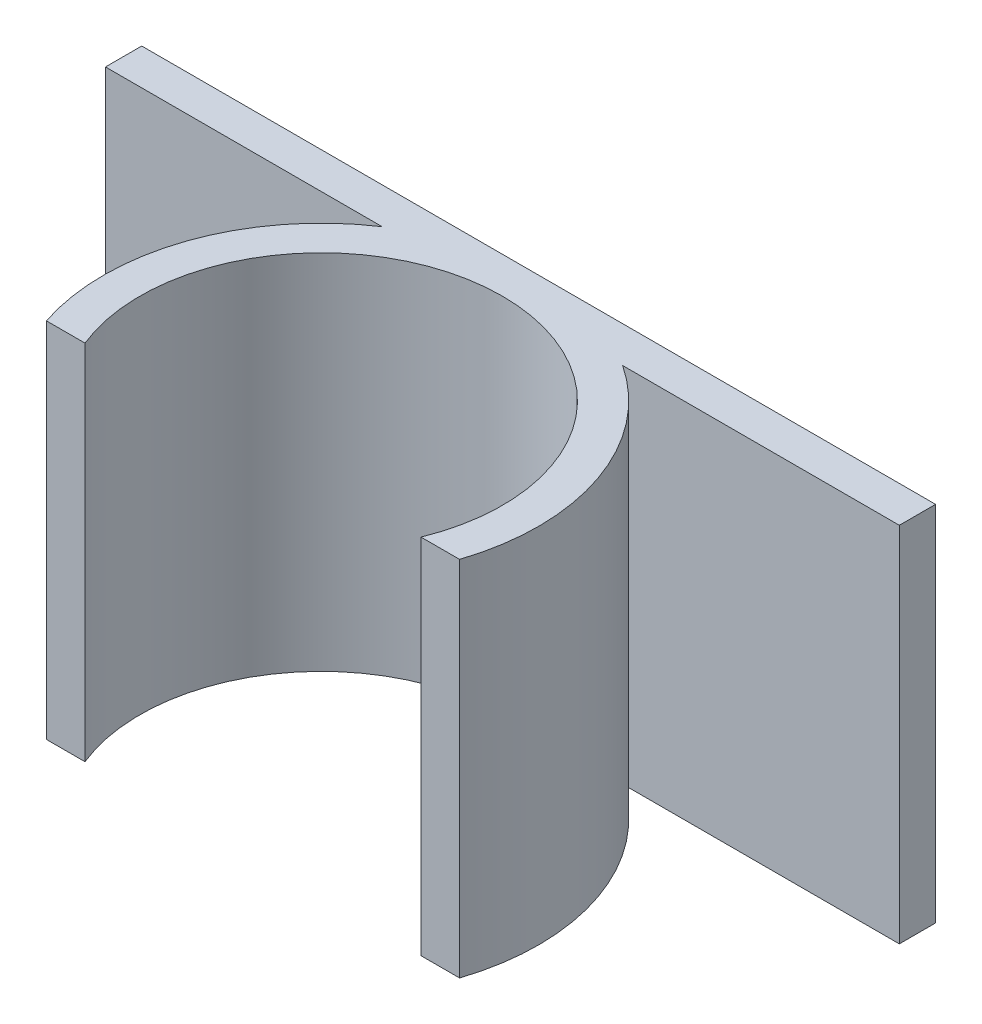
ISO-10303-21;
HEADER;
FILE_DESCRIPTION(('STEP AP214'),'2;1');
FILE_NAME('part.step','',(''),(''),'','','');
FILE_SCHEMA(('AUTOMOTIVE_DESIGN { 1 0 10303 214 1 1 1 1 }'));
ENDSEC;
DATA;
#1=APPLICATION_CONTEXT('core data for automotive mechanical design processes');
#2=APPLICATION_PROTOCOL_DEFINITION('international standard','automotive_design',2000,#1);
#3=PRODUCT_CONTEXT('',#1,'mechanical');
#4=PRODUCT('Part','Part','',(#3));
#5=PRODUCT_RELATED_PRODUCT_CATEGORY('part','',(#4));
#6=PRODUCT_DEFINITION_FORMATION('','',#4);
#7=PRODUCT_DEFINITION_CONTEXT('part definition',#1,'design');
#8=PRODUCT_DEFINITION('design','',#6,#7);
#9=PRODUCT_DEFINITION_SHAPE('','',#8);
#10=(LENGTH_UNIT() NAMED_UNIT(*) SI_UNIT(.MILLI.,.METRE.));
#11=(NAMED_UNIT(*) PLANE_ANGLE_UNIT() SI_UNIT($,.RADIAN.));
#12=(NAMED_UNIT(*) SI_UNIT($,.STERADIAN.) SOLID_ANGLE_UNIT());
#13=UNCERTAINTY_MEASURE_WITH_UNIT(LENGTH_MEASURE(1.E-05),#10,'distance_accuracy_value','');
#14=(GEOMETRIC_REPRESENTATION_CONTEXT(3) GLOBAL_UNCERTAINTY_ASSIGNED_CONTEXT((#13)) GLOBAL_UNIT_ASSIGNED_CONTEXT((#10,
#11,#12)) REPRESENTATION_CONTEXT('',''));
#15=CARTESIAN_POINT('',(0.,0.,0.));
#16=DIRECTION('',(0.,0.,1.));
#17=DIRECTION('',(1.,0.,0.));
#18=AXIS2_PLACEMENT_3D('',#15,#16,#17);
#19=CARTESIAN_POINT('',(0.,10.,0.));
#20=DIRECTION('',(0.,-1.,0.));
#21=DIRECTION('',(0.,0.,-1.));
#22=AXIS2_PLACEMENT_3D('',#19,#20,#21);
#23=CYLINDRICAL_SURFACE('',#22,6.);
#24=CARTESIAN_POINT('',(0.,0.,0.));
#25=DIRECTION('',(0.,1.,0.));
#26=DIRECTION('',(0.,0.,1.));
#27=AXIS2_PLACEMENT_3D('',#24,#25,#26);
#28=CIRCLE('',#27,6.);
#29=CARTESIAN_POINT('',(-3.31662479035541,0.,-5.));
#30=VERTEX_POINT('',#29);
#31=CARTESIAN_POINT('',(-5.69809388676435,0.,1.87928871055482));
#32=VERTEX_POINT('',#31);
#33=EDGE_CURVE('E156',#30,#32,#28,.T.);
#34=ORIENTED_EDGE('',*,*,#33,.T.);
#35=DIRECTION('',(0.,-1.,0.));
#36=VECTOR('',#35,1.);
#37=CARTESIAN_POINT('',(-5.69809388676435,10.,1.87928871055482));
#38=LINE('',#37,#36);
#39=CARTESIAN_POINT('',(-5.69809388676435,10.,1.87928871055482));
#40=VERTEX_POINT('',#39);
#41=EDGE_CURVE('E141',#32,#40,#38,.F.);
#42=ORIENTED_EDGE('',*,*,#41,.T.);
#43=CARTESIAN_POINT('',(0.,10.,0.));
#44=DIRECTION('',(0.,1.,0.));
#45=DIRECTION('',(0.,0.,1.));
#46=AXIS2_PLACEMENT_3D('',#43,#44,#45);
#47=CIRCLE('',#46,6.);
#48=CARTESIAN_POINT('',(-3.31662479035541,10.,-5.));
#49=VERTEX_POINT('',#48);
#50=EDGE_CURVE('E169',#49,#40,#47,.T.);
#51=ORIENTED_EDGE('',*,*,#50,.F.);
#52=DIRECTION('',(0.,-1.,0.));
#53=VECTOR('',#52,1.);
#54=CARTESIAN_POINT('',(-3.31662479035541,10.,-5.));
#55=LINE('',#54,#53);
#56=EDGE_CURVE('E164',#49,#30,#55,.T.);
#57=ORIENTED_EDGE('',*,*,#56,.T.);
#58=EDGE_LOOP('',(#34,#42,#51,#57));
#59=FACE_BOUND('',#58,.T.);
#60=ADVANCED_FACE('F67',(#59),#23,.T.);
#61=CARTESIAN_POINT('',(5.69809388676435,10.,1.87928871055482));
#62=VERTEX_POINT('',#61);
#63=CARTESIAN_POINT('',(3.31662479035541,10.,-5.));
#64=VERTEX_POINT('',#63);
#65=EDGE_CURVE('E166',#62,#64,#47,.T.);
#66=ORIENTED_EDGE('',*,*,#65,.F.);
#67=DIRECTION('',(0.,-1.,0.));
#68=VECTOR('',#67,1.);
#69=CARTESIAN_POINT('',(5.69809388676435,10.,1.87928871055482));
#70=LINE('',#69,#68);
#71=CARTESIAN_POINT('',(5.69809388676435,0.,1.87928871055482));
#72=VERTEX_POINT('',#71);
#73=EDGE_CURVE('E149',#62,#72,#70,.T.);
#74=ORIENTED_EDGE('',*,*,#73,.T.);
#75=CARTESIAN_POINT('',(3.31662479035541,0.,-5.));
#76=VERTEX_POINT('',#75);
#77=EDGE_CURVE('E167',#72,#76,#28,.T.);
#78=ORIENTED_EDGE('',*,*,#77,.T.);
#79=DIRECTION('',(0.,-1.,0.));
#80=VECTOR('',#79,1.);
#81=CARTESIAN_POINT('',(3.31662479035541,10.,-5.));
#82=LINE('',#81,#80);
#83=EDGE_CURVE('E208',#64,#76,#82,.T.);
#84=ORIENTED_EDGE('',*,*,#83,.F.);
#85=EDGE_LOOP('',(#66,#74,#78,#84));
#86=FACE_BOUND('',#85,.T.);
#87=ADVANCED_FACE('F69',(#86),#23,.T.);
#88=CARTESIAN_POINT('',(0.,10.,0.));
#89=DIRECTION('',(0.,1.,0.));
#90=DIRECTION('',(0.,0.,1.));
#91=AXIS2_PLACEMENT_3D('',#88,#89,#90);
#92=PLANE('',#91);
#93=DIRECTION('',(1.,0.,0.));
#94=VECTOR('',#93,1.);
#95=CARTESIAN_POINT('',(-7.16333601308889,10.,1.87928871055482));
#96=LINE('',#95,#94);
#97=CARTESIAN_POINT('',(4.63338687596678,10.,1.87928871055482));
#98=VERTEX_POINT('',#97);
#99=EDGE_CURVE('E89',#98,#62,#96,.T.);
#100=ORIENTED_EDGE('',*,*,#99,.T.);
#101=ORIENTED_EDGE('',*,*,#65,.T.);
#102=DIRECTION('',(1.,0.,0.));
#103=VECTOR('',#102,1.);
#104=CARTESIAN_POINT('',(0.,10.,-5.));
#105=LINE('',#104,#103);
#106=CARTESIAN_POINT('',(10.9483288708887,10.,-5.));
#107=VERTEX_POINT('',#106);
#108=EDGE_CURVE('E225',#64,#107,#105,.T.);
#109=ORIENTED_EDGE('',*,*,#108,.T.);
#110=DIRECTION('',(0.,0.,1.));
#111=VECTOR('',#110,1.);
#112=CARTESIAN_POINT('',(10.9483288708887,10.,0.));
#113=LINE('',#112,#111);
#114=CARTESIAN_POINT('',(10.9483288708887,10.,-6.));
#115=VERTEX_POINT('',#114);
#116=EDGE_CURVE('E212',#115,#107,#113,.T.);
#117=ORIENTED_EDGE('',*,*,#116,.F.);
#118=DIRECTION('',(1.,0.,0.));
#119=VECTOR('',#118,1.);
#120=CARTESIAN_POINT('',(0.,10.,-6.));
#121=LINE('',#120,#119);
#122=CARTESIAN_POINT('',(-10.9483288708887,10.,-6.));
#123=VERTEX_POINT('',#122);
#124=EDGE_CURVE('E198',#123,#115,#121,.T.);
#125=ORIENTED_EDGE('',*,*,#124,.F.);
#126=DIRECTION('',(0.,0.,1.));
#127=VECTOR('',#126,1.);
#128=CARTESIAN_POINT('',(-10.9483288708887,10.,0.));
#129=LINE('',#128,#127);
#130=CARTESIAN_POINT('',(-10.9483288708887,10.,-5.));
#131=VERTEX_POINT('',#130);
#132=EDGE_CURVE('E182',#123,#131,#129,.T.);
#133=ORIENTED_EDGE('',*,*,#132,.T.);
#134=DIRECTION('',(1.,0.,0.));
#135=VECTOR('',#134,1.);
#136=CARTESIAN_POINT('',(0.,10.,-5.));
#137=LINE('',#136,#135);
#138=EDGE_CURVE('E179',#131,#49,#137,.T.);
#139=ORIENTED_EDGE('',*,*,#138,.T.);
#140=ORIENTED_EDGE('',*,*,#50,.T.);
#141=CARTESIAN_POINT('',(-4.63338687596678,10.,1.87928871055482));
#142=VERTEX_POINT('',#141);
#143=EDGE_CURVE('E144',#40,#142,#96,.T.);
#144=ORIENTED_EDGE('',*,*,#143,.T.);
#145=CARTESIAN_POINT('',(0.,10.,0.));
#146=DIRECTION('',(0.,1.,0.));
#147=DIRECTION('',(0.,0.,1.));
#148=AXIS2_PLACEMENT_3D('',#145,#146,#147);
#149=CIRCLE('',#148,5.);
#150=EDGE_CURVE('E171',#98,#142,#149,.T.);
#151=ORIENTED_EDGE('',*,*,#150,.F.);
#152=EDGE_LOOP('',(#100,#101,#109,#117,#125,#133,#139,#140,#144,#151));
#153=FACE_BOUND('',#152,.T.);
#154=ADVANCED_FACE('F175',(#153),#92,.T.);
#155=CARTESIAN_POINT('',(0.,0.,0.));
#156=DIRECTION('',(0.,1.,0.));
#157=DIRECTION('',(0.,0.,1.));
#158=AXIS2_PLACEMENT_3D('',#155,#156,#157);
#159=PLANE('',#158);
#160=ORIENTED_EDGE('',*,*,#77,.F.);
#161=DIRECTION('',(1.,0.,0.));
#162=VECTOR('',#161,1.);
#163=CARTESIAN_POINT('',(-7.16333601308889,0.,1.87928871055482));
#164=LINE('',#163,#162);
#165=CARTESIAN_POINT('',(4.63338687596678,0.,1.87928871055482));
#166=VERTEX_POINT('',#165);
#167=EDGE_CURVE('E161',#166,#72,#164,.T.);
#168=ORIENTED_EDGE('',*,*,#167,.F.);
#169=CARTESIAN_POINT('',(0.,0.,0.));
#170=DIRECTION('',(0.,1.,0.));
#171=DIRECTION('',(0.,0.,1.));
#172=AXIS2_PLACEMENT_3D('',#169,#170,#171);
#173=CIRCLE('',#172,5.);
#174=CARTESIAN_POINT('',(-4.63338687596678,0.,1.87928871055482));
#175=VERTEX_POINT('',#174);
#176=EDGE_CURVE('E160',#166,#175,#173,.T.);
#177=ORIENTED_EDGE('',*,*,#176,.T.);
#178=EDGE_CURVE('E82',#32,#175,#164,.T.);
#179=ORIENTED_EDGE('',*,*,#178,.F.);
#180=ORIENTED_EDGE('',*,*,#33,.F.);
#181=DIRECTION('',(1.,0.,0.));
#182=VECTOR('',#181,1.);
#183=CARTESIAN_POINT('',(0.,0.,-5.));
#184=LINE('',#183,#182);
#185=CARTESIAN_POINT('',(-10.9483288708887,0.,-5.));
#186=VERTEX_POINT('',#185);
#187=EDGE_CURVE('E189',#186,#30,#184,.T.);
#188=ORIENTED_EDGE('',*,*,#187,.F.);
#189=DIRECTION('',(0.,0.,1.));
#190=VECTOR('',#189,1.);
#191=CARTESIAN_POINT('',(-10.9483288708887,0.,0.));
#192=LINE('',#191,#190);
#193=CARTESIAN_POINT('',(-10.9483288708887,0.,-6.));
#194=VERTEX_POINT('',#193);
#195=EDGE_CURVE('E229',#194,#186,#192,.T.);
#196=ORIENTED_EDGE('',*,*,#195,.F.);
#197=DIRECTION('',(1.,0.,0.));
#198=VECTOR('',#197,1.);
#199=CARTESIAN_POINT('',(0.,0.,-6.));
#200=LINE('',#199,#198);
#201=CARTESIAN_POINT('',(10.9483288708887,0.,-6.));
#202=VERTEX_POINT('',#201);
#203=EDGE_CURVE('E186',#194,#202,#200,.T.);
#204=ORIENTED_EDGE('',*,*,#203,.T.);
#205=DIRECTION('',(0.,0.,1.));
#206=VECTOR('',#205,1.);
#207=CARTESIAN_POINT('',(10.9483288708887,0.,0.));
#208=LINE('',#207,#206);
#209=CARTESIAN_POINT('',(10.9483288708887,0.,-5.));
#210=VERTEX_POINT('',#209);
#211=EDGE_CURVE('E222',#202,#210,#208,.T.);
#212=ORIENTED_EDGE('',*,*,#211,.T.);
#213=DIRECTION('',(1.,0.,0.));
#214=VECTOR('',#213,1.);
#215=CARTESIAN_POINT('',(0.,0.,-5.));
#216=LINE('',#215,#214);
#217=EDGE_CURVE('E213',#76,#210,#216,.T.);
#218=ORIENTED_EDGE('',*,*,#217,.F.);
#219=EDGE_LOOP('',(#160,#168,#177,#179,#180,#188,#196,#204,#212,#218));
#220=FACE_BOUND('',#219,.T.);
#221=ADVANCED_FACE('F154',(#220),#159,.F.);
#222=CARTESIAN_POINT('',(0.,10.,0.));
#223=DIRECTION('',(0.,-1.,0.));
#224=DIRECTION('',(0.,0.,-1.));
#225=AXIS2_PLACEMENT_3D('',#222,#223,#224);
#226=CYLINDRICAL_SURFACE('',#225,5.);
#227=DIRECTION('',(0.,-1.,0.));
#228=VECTOR('',#227,1.);
#229=CARTESIAN_POINT('',(4.63338687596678,10.,1.87928871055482));
#230=LINE('',#229,#228);
#231=EDGE_CURVE('E12',#98,#166,#230,.T.);
#232=ORIENTED_EDGE('',*,*,#231,.F.);
#233=ORIENTED_EDGE('',*,*,#150,.T.);
#234=DIRECTION('',(0.,-1.,0.));
#235=VECTOR('',#234,1.);
#236=CARTESIAN_POINT('',(-4.63338687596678,10.,1.87928871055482));
#237=LINE('',#236,#235);
#238=EDGE_CURVE('E75',#175,#142,#237,.F.);
#239=ORIENTED_EDGE('',*,*,#238,.F.);
#240=ORIENTED_EDGE('',*,*,#176,.F.);
#241=EDGE_LOOP('',(#232,#233,#239,#240));
#242=FACE_BOUND('',#241,.T.);
#243=ADVANCED_FACE('F200',(#242),#226,.F.);
#244=CARTESIAN_POINT('',(0.,10.,-5.));
#245=DIRECTION('',(0.,0.,-1.));
#246=DIRECTION('',(-1.,0.,0.));
#247=AXIS2_PLACEMENT_3D('',#244,#245,#246);
#248=PLANE('',#247);
#249=ORIENTED_EDGE('',*,*,#187,.T.);
#250=ORIENTED_EDGE('',*,*,#56,.F.);
#251=ORIENTED_EDGE('',*,*,#138,.F.);
#252=DIRECTION('',(0.,-1.,0.));
#253=VECTOR('',#252,1.);
#254=CARTESIAN_POINT('',(-10.9483288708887,10.,-5.));
#255=LINE('',#254,#253);
#256=EDGE_CURVE('E192',#131,#186,#255,.T.);
#257=ORIENTED_EDGE('',*,*,#256,.T.);
#258=EDGE_LOOP('',(#249,#250,#251,#257));
#259=FACE_BOUND('',#258,.T.);
#260=ADVANCED_FACE('F188',(#259),#248,.F.);
#261=CARTESIAN_POINT('',(0.,10.,-6.));
#262=DIRECTION('',(0.,0.,-1.));
#263=DIRECTION('',(-1.,0.,0.));
#264=AXIS2_PLACEMENT_3D('',#261,#262,#263);
#265=PLANE('',#264);
#266=ORIENTED_EDGE('',*,*,#203,.F.);
#267=DIRECTION('',(0.,-1.,0.));
#268=VECTOR('',#267,1.);
#269=CARTESIAN_POINT('',(-10.9483288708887,10.,-6.));
#270=LINE('',#269,#268);
#271=EDGE_CURVE('E190',#123,#194,#270,.T.);
#272=ORIENTED_EDGE('',*,*,#271,.F.);
#273=ORIENTED_EDGE('',*,*,#124,.T.);
#274=DIRECTION('',(0.,-1.,0.));
#275=VECTOR('',#274,1.);
#276=CARTESIAN_POINT('',(10.9483288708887,10.,-6.));
#277=LINE('',#276,#275);
#278=EDGE_CURVE('E148',#115,#202,#277,.T.);
#279=ORIENTED_EDGE('',*,*,#278,.T.);
#280=EDGE_LOOP('',(#266,#272,#273,#279));
#281=FACE_BOUND('',#280,.T.);
#282=ADVANCED_FACE('F237',(#281),#265,.T.);
#283=CARTESIAN_POINT('',(-10.9483288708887,10.,0.));
#284=DIRECTION('',(1.,0.,0.));
#285=DIRECTION('',(0.,0.,-1.));
#286=AXIS2_PLACEMENT_3D('',#283,#284,#285);
#287=PLANE('',#286);
#288=ORIENTED_EDGE('',*,*,#195,.T.);
#289=ORIENTED_EDGE('',*,*,#256,.F.);
#290=ORIENTED_EDGE('',*,*,#132,.F.);
#291=ORIENTED_EDGE('',*,*,#271,.T.);
#292=EDGE_LOOP('',(#288,#289,#290,#291));
#293=FACE_BOUND('',#292,.T.);
#294=ADVANCED_FACE('F268',(#293),#287,.F.);
#295=CARTESIAN_POINT('',(0.,10.,-5.));
#296=DIRECTION('',(0.,0.,-1.));
#297=DIRECTION('',(-1.,0.,0.));
#298=AXIS2_PLACEMENT_3D('',#295,#296,#297);
#299=PLANE('',#298);
#300=ORIENTED_EDGE('',*,*,#217,.T.);
#301=DIRECTION('',(0.,-1.,0.));
#302=VECTOR('',#301,1.);
#303=CARTESIAN_POINT('',(10.9483288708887,10.,-5.));
#304=LINE('',#303,#302);
#305=EDGE_CURVE('E216',#107,#210,#304,.T.);
#306=ORIENTED_EDGE('',*,*,#305,.F.);
#307=ORIENTED_EDGE('',*,*,#108,.F.);
#308=ORIENTED_EDGE('',*,*,#83,.T.);
#309=EDGE_LOOP('',(#300,#306,#307,#308));
#310=FACE_BOUND('',#309,.T.);
#311=ADVANCED_FACE('F242',(#310),#299,.F.);
#312=CARTESIAN_POINT('',(10.9483288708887,10.,0.));
#313=DIRECTION('',(1.,0.,0.));
#314=DIRECTION('',(0.,0.,-1.));
#315=AXIS2_PLACEMENT_3D('',#312,#313,#314);
#316=PLANE('',#315);
#317=ORIENTED_EDGE('',*,*,#211,.F.);
#318=ORIENTED_EDGE('',*,*,#278,.F.);
#319=ORIENTED_EDGE('',*,*,#116,.T.);
#320=ORIENTED_EDGE('',*,*,#305,.T.);
#321=EDGE_LOOP('',(#317,#318,#319,#320));
#322=FACE_BOUND('',#321,.T.);
#323=ADVANCED_FACE('F240',(#322),#316,.T.);
#324=CARTESIAN_POINT('',(-7.16333601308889,10.,1.87928871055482));
#325=DIRECTION('',(0.,0.,-1.));
#326=DIRECTION('',(-1.,0.,0.));
#327=AXIS2_PLACEMENT_3D('',#324,#325,#326);
#328=PLANE('',#327);
#329=ORIENTED_EDGE('',*,*,#178,.T.);
#330=ORIENTED_EDGE('',*,*,#238,.T.);
#331=ORIENTED_EDGE('',*,*,#143,.F.);
#332=ORIENTED_EDGE('',*,*,#41,.F.);
#333=EDGE_LOOP('',(#329,#330,#331,#332));
#334=FACE_BOUND('',#333,.T.);
#335=ADVANCED_FACE('F142',(#334),#328,.F.);
#336=ORIENTED_EDGE('',*,*,#99,.F.);
#337=ORIENTED_EDGE('',*,*,#231,.T.);
#338=ORIENTED_EDGE('',*,*,#167,.T.);
#339=ORIENTED_EDGE('',*,*,#73,.F.);
#340=EDGE_LOOP('',(#336,#337,#338,#339));
#341=FACE_BOUND('',#340,.T.);
#342=ADVANCED_FACE('F244',(#341),#328,.F.);
#343=CLOSED_SHELL('',(#60,#87,#154,#221,#243,#260,#282,#294,#311,#323,#335,#342));
#344=MANIFOLD_SOLID_BREP('B2',#343);
#345=ADVANCED_BREP_SHAPE_REPRESENTATION('',(#18,#344),#14);
#346=SHAPE_DEFINITION_REPRESENTATION(#9,#345);
ENDSEC;
END-ISO-10303-21;
